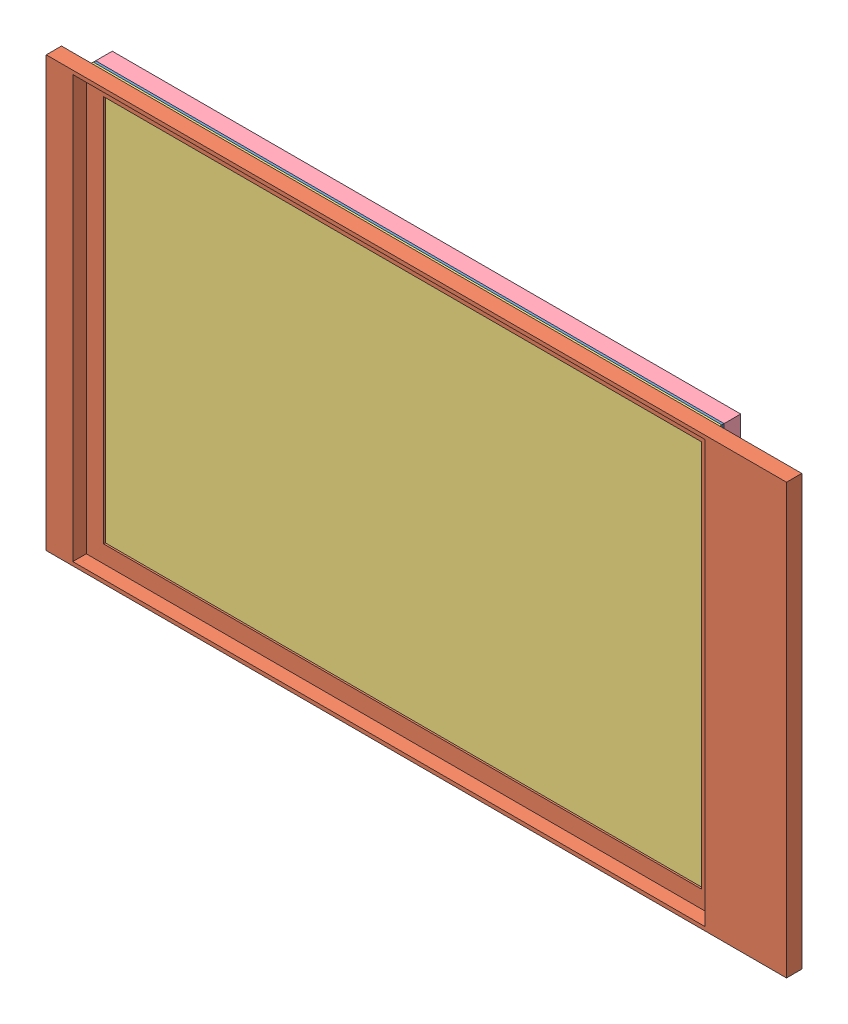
SolidWorks assembly emsamble tapa vidrio.SLDASM, configuration Predeterminado (file format 4400). Lengths in mm.
Overall size (1115.5 647 54.5).
4 component instances, 4 part files, 9 mates.
Components (placement in the parent):
- separador de vidrio-1: separador de vidrio.SLDPRT [Predeterminado] at (-474.019 -255.4135 -1.75) size (947 638.5 3.5)
- soporte vidrio-1: soporte vidrio.SLDPRT [Predeterminado] at (-557.019 -301.9135 4.75) size (1115.5 647 23)
- vidrio delgado-1: vidrio delgado.SLDPRT [Predeterminado] at (-474.019 -255.4135 1.75) size (947 638.5 3)
- vidrio grueso-1: vidrio grueso.SLDPRT [Predeterminado] at (-474.019 -255.4135 -26.75) size (947 638.5 25)
Mates (geometry in assembly coordinates):
- Coincidente1: coincident anti-aligned: plane of soporte vidrio-1 through (-557.019 421.0865 4.75) normal (0 0 -1); plane of vidrio delgado-1 through (-474.019 383.0865 4.75) normal (0 0 1)
- Distancia1: distance = 45 mm aligned: plane of vidrio delgado-1 through (-474.019 -255.4135 4.75) normal (-1 0 0); plane of soporte vidrio-1 through (-519.019 -263.9135 4.749) normal (-1 0 0)
- Coincidente3: coincident aligned: plane of soporte vidrio-1 through (634.481 383.0865 25.09) normal (0 1 0); plane of vidrio delgado-1 through (-474.019 383.0865 4.75) normal (0 1 0)
- Coincidente4: coincident anti-aligned: plane of separador de vidrio-1 through (-474.019 383.0865 1.75) normal (0 0 1); plane of vidrio delgado-1 through (-474.019 383.0865 1.75) normal (0 0 -1)
- Distancia2: distance = 45 mm aligned: plane of separador de vidrio-1 through (-474.019 -255.4135 1.75) normal (-1 0 0); plane of soporte vidrio-1 through (-519.019 -263.9135 4.749) normal (-1 0 0)
- Coincidente6: coincident aligned: plane of separador de vidrio-1 through (-474.019 383.0865 1.75) normal (0 1 0); plane of vidrio delgado-1 through (-474.019 383.0865 4.75) normal (0 1 0)
- Coincidente7: coincident anti-aligned: plane of separador de vidrio-1 through (-474.019 383.0865 -1.75) normal (0 0 -1); plane of vidrio grueso-1 through (-474.019 383.0865 -1.75) normal (0 0 1)
- Distancia3: distance = 45 mm aligned: plane of vidrio grueso-1 through (-474.019 -255.4135 -1.75) normal (-1 0 0); plane of soporte vidrio-1 through (-519.019 -263.9135 4.749) normal (-1 0 0)
- Coincidente9: coincident aligned: plane of soporte vidrio-1 through (634.481 383.0865 25.09) normal (0 1 0); plane of vidrio grueso-1 through (-474.019 383.0865 -1.75) normal (0 1 0)
